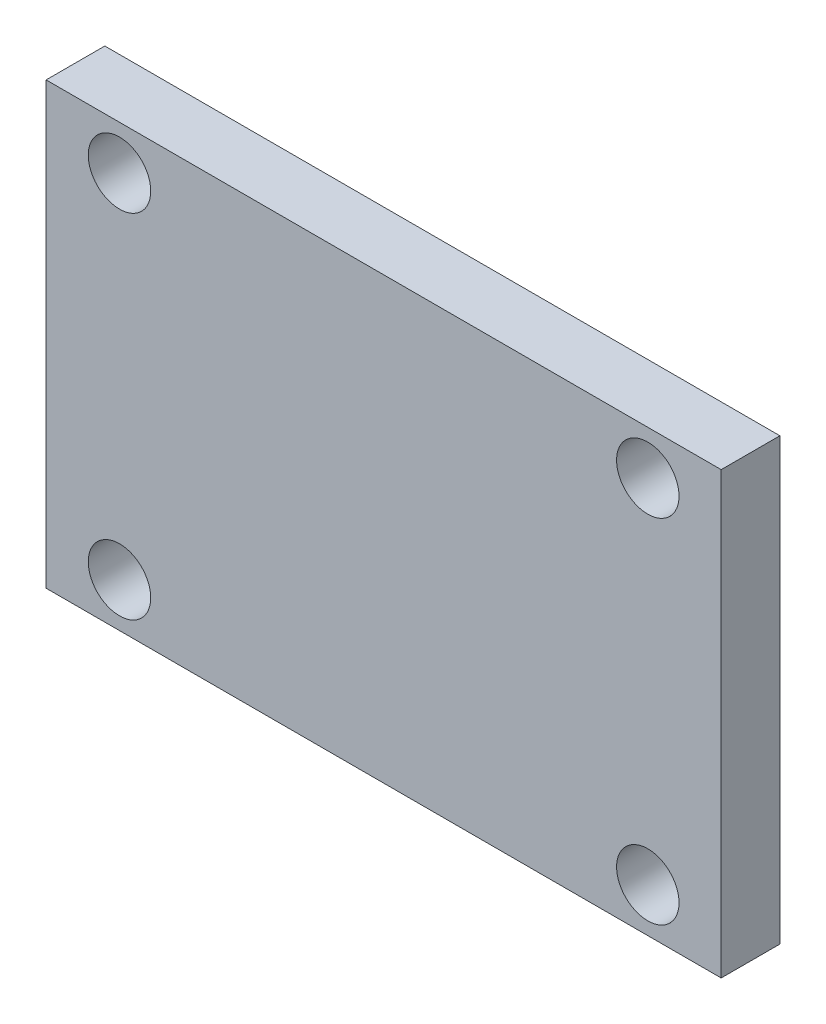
from build123d import *

# Parameters (mm, degrees)
SKETCH1_W               = 73.025
SKETCH1_H               = 47.625
EXTRUDE1_DEPTH          = 6.35
F_1_4_CLEARANCE_HOLE1_D = 6.7564


with BuildPart() as part:
    # Sketch1 → Extrude1 (new body)
    with BuildSketch(Plane.XY):
        with Locations((36.5125, 23.8125)):
            Rectangle(SKETCH1_W, SKETCH1_H)
    extrude(amount=EXTRUDE1_DEPTH)

    # 1_4 Clearance Hole1 (through all)
    with Locations(Plane.XY.offset(6.35)):
        with Locations((7.9375, 42.8625), (65.0875, 42.8625), (65.0875, 4.7625), (7.9375, 4.7625)):
            Hole(F_1_4_CLEARANCE_HOLE1_D / 2)


solid = part.part
